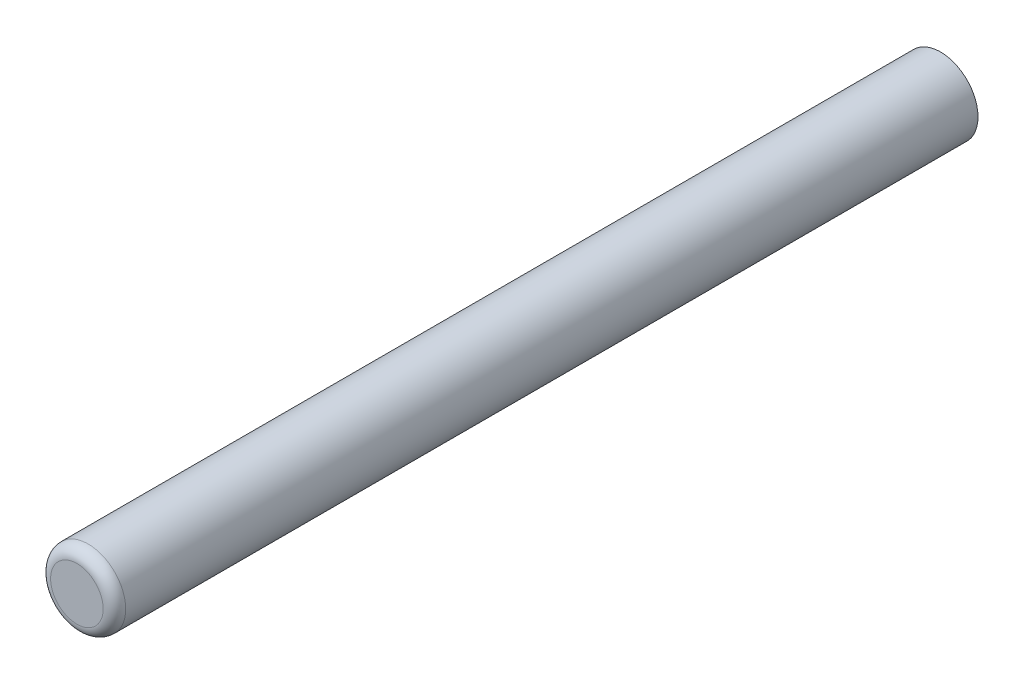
ISO-10303-21;
HEADER;
FILE_DESCRIPTION(('STEP AP214'),'2;1');
FILE_NAME('part.step','',(''),(''),'','','');
FILE_SCHEMA(('AUTOMOTIVE_DESIGN { 1 0 10303 214 1 1 1 1 }'));
ENDSEC;
DATA;
#1=APPLICATION_CONTEXT('core data for automotive mechanical design processes');
#2=APPLICATION_PROTOCOL_DEFINITION('international standard','automotive_design',2000,#1);
#3=PRODUCT_CONTEXT('',#1,'mechanical');
#4=PRODUCT('Part','Part','',(#3));
#5=PRODUCT_RELATED_PRODUCT_CATEGORY('part','',(#4));
#6=PRODUCT_DEFINITION_FORMATION('','',#4);
#7=PRODUCT_DEFINITION_CONTEXT('part definition',#1,'design');
#8=PRODUCT_DEFINITION('design','',#6,#7);
#9=PRODUCT_DEFINITION_SHAPE('','',#8);
#10=(LENGTH_UNIT() NAMED_UNIT(*) SI_UNIT(.MILLI.,.METRE.));
#11=(NAMED_UNIT(*) PLANE_ANGLE_UNIT() SI_UNIT($,.RADIAN.));
#12=(NAMED_UNIT(*) SI_UNIT($,.STERADIAN.) SOLID_ANGLE_UNIT());
#13=UNCERTAINTY_MEASURE_WITH_UNIT(LENGTH_MEASURE(1.E-05),#10,'distance_accuracy_value','');
#14=(GEOMETRIC_REPRESENTATION_CONTEXT(3) GLOBAL_UNCERTAINTY_ASSIGNED_CONTEXT((#13)) GLOBAL_UNIT_ASSIGNED_CONTEXT((#10,
#11,#12)) REPRESENTATION_CONTEXT('',''));
#15=CARTESIAN_POINT('',(0.,0.,0.));
#16=DIRECTION('',(0.,0.,1.));
#17=DIRECTION('',(1.,0.,0.));
#18=AXIS2_PLACEMENT_3D('',#15,#16,#17);
#19=CARTESIAN_POINT('',(0.,0.,23.));
#20=DIRECTION('',(0.,0.,-1.));
#21=DIRECTION('',(-1.,0.,0.));
#22=AXIS2_PLACEMENT_3D('',#19,#20,#21);
#23=CYLINDRICAL_SURFACE('',#22,1.);
#24=CARTESIAN_POINT('',(0.,0.,22.7));
#25=DIRECTION('',(0.,0.,1.));
#26=DIRECTION('',(1.,0.,0.));
#27=AXIS2_PLACEMENT_3D('',#24,#25,#26);
#28=CIRCLE('',#27,1.);
#29=CARTESIAN_POINT('',(1.,0.,22.7));
#30=VERTEX_POINT('',#29);
#31=EDGE_CURVE('E10',#30,#30,#28,.F.);
#32=ORIENTED_EDGE('',*,*,#31,.T.);
#33=EDGE_LOOP('',(#32));
#34=FACE_BOUND('',#33,.T.);
#35=CARTESIAN_POINT('',(0.,0.,0.));
#36=DIRECTION('',(0.,0.,1.));
#37=DIRECTION('',(1.,0.,0.));
#38=AXIS2_PLACEMENT_3D('',#35,#36,#37);
#39=CIRCLE('',#38,1.);
#40=CARTESIAN_POINT('',(1.,0.,0.));
#41=VERTEX_POINT('',#40);
#42=EDGE_CURVE('E34',#41,#41,#39,.T.);
#43=ORIENTED_EDGE('',*,*,#42,.T.);
#44=EDGE_LOOP('',(#43));
#45=FACE_BOUND('',#44,.T.);
#46=ADVANCED_FACE('F24',(#34,#45),#23,.T.);
#47=CARTESIAN_POINT('',(0.,0.,23.));
#48=DIRECTION('',(0.,0.,1.));
#49=DIRECTION('',(1.,0.,0.));
#50=AXIS2_PLACEMENT_3D('',#47,#48,#49);
#51=PLANE('',#50);
#52=CARTESIAN_POINT('',(0.,0.,23.));
#53=DIRECTION('',(0.,0.,1.));
#54=DIRECTION('',(1.,0.,0.));
#55=AXIS2_PLACEMENT_3D('',#52,#53,#54);
#56=CIRCLE('',#55,0.7);
#57=CARTESIAN_POINT('',(0.7,0.,23.));
#58=VERTEX_POINT('',#57);
#59=EDGE_CURVE('E30',#58,#58,#56,.T.);
#60=ORIENTED_EDGE('',*,*,#59,.T.);
#61=EDGE_LOOP('',(#60));
#62=FACE_BOUND('',#61,.T.);
#63=ADVANCED_FACE('F45',(#62),#51,.T.);
#64=CARTESIAN_POINT('',(0.,0.,0.));
#65=DIRECTION('',(0.,0.,1.));
#66=DIRECTION('',(1.,0.,0.));
#67=AXIS2_PLACEMENT_3D('',#64,#65,#66);
#68=PLANE('',#67);
#69=ORIENTED_EDGE('',*,*,#42,.F.);
#70=EDGE_LOOP('',(#69));
#71=FACE_BOUND('',#70,.T.);
#72=ADVANCED_FACE('F42',(#71),#68,.F.);
#73=CARTESIAN_POINT('',(0.,0.,22.7));
#74=DIRECTION('',(0.,0.,1.));
#75=DIRECTION('',(1.,0.,0.));
#76=AXIS2_PLACEMENT_3D('',#73,#74,#75);
#77=TOROIDAL_SURFACE('',#76,0.7,0.3);
#78=ORIENTED_EDGE('',*,*,#31,.F.);
#79=EDGE_LOOP('',(#78));
#80=FACE_BOUND('',#79,.T.);
#81=ORIENTED_EDGE('',*,*,#59,.F.);
#82=EDGE_LOOP('',(#81));
#83=FACE_BOUND('',#82,.T.);
#84=ADVANCED_FACE('F44',(#80,#83),#77,.T.);
#85=CLOSED_SHELL('',(#46,#63,#72,#84));
#86=MANIFOLD_SOLID_BREP('B2',#85);
#87=ADVANCED_BREP_SHAPE_REPRESENTATION('',(#18,#86),#14);
#88=SHAPE_DEFINITION_REPRESENTATION(#9,#87);
ENDSEC;
END-ISO-10303-21;
